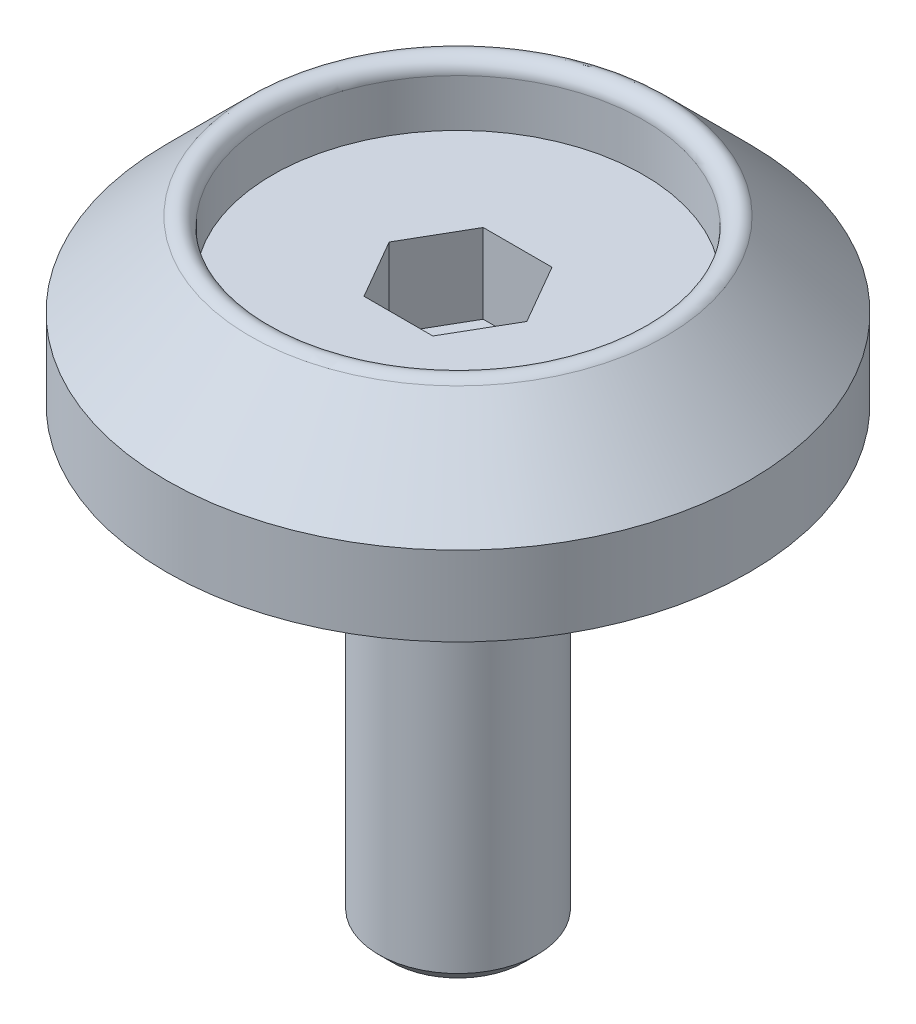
ISO-10303-21;
HEADER;
FILE_DESCRIPTION(('STEP AP214'),'2;1');
FILE_NAME('part.step','',(''),(''),'','','');
FILE_SCHEMA(('AUTOMOTIVE_DESIGN { 1 0 10303 214 1 1 1 1 }'));
ENDSEC;
DATA;
#1=APPLICATION_CONTEXT('core data for automotive mechanical design processes');
#2=APPLICATION_PROTOCOL_DEFINITION('international standard','automotive_design',2000,#1);
#3=PRODUCT_CONTEXT('',#1,'mechanical');
#4=PRODUCT('Part','Part','',(#3));
#5=PRODUCT_RELATED_PRODUCT_CATEGORY('part','',(#4));
#6=PRODUCT_DEFINITION_FORMATION('','',#4);
#7=PRODUCT_DEFINITION_CONTEXT('part definition',#1,'design');
#8=PRODUCT_DEFINITION('design','',#6,#7);
#9=PRODUCT_DEFINITION_SHAPE('','',#8);
#10=(LENGTH_UNIT() NAMED_UNIT(*) SI_UNIT(.MILLI.,.METRE.));
#11=(NAMED_UNIT(*) PLANE_ANGLE_UNIT() SI_UNIT($,.RADIAN.));
#12=(NAMED_UNIT(*) SI_UNIT($,.STERADIAN.) SOLID_ANGLE_UNIT());
#13=UNCERTAINTY_MEASURE_WITH_UNIT(LENGTH_MEASURE(1.E-05),#10,'distance_accuracy_value','');
#14=(GEOMETRIC_REPRESENTATION_CONTEXT(3) GLOBAL_UNCERTAINTY_ASSIGNED_CONTEXT((#13)) GLOBAL_UNIT_ASSIGNED_CONTEXT((#10,
#11,#12)) REPRESENTATION_CONTEXT('',''));
#15=CARTESIAN_POINT('',(0.,0.,0.));
#16=DIRECTION('',(0.,0.,1.));
#17=DIRECTION('',(1.,0.,0.));
#18=AXIS2_PLACEMENT_3D('',#15,#16,#17);
#19=CARTESIAN_POINT('',(0.,0.,0.));
#20=DIRECTION('',(0.,-1.,0.));
#21=DIRECTION('',(1.,0.,0.));
#22=AXIS2_PLACEMENT_3D('',#19,#20,#21);
#23=PLANE('',#22);
#24=CARTESIAN_POINT('',(0.,0.,0.));
#25=DIRECTION('',(0.,-1.,0.));
#26=DIRECTION('',(1.,0.,0.));
#27=AXIS2_PLACEMENT_3D('',#24,#25,#26);
#28=CIRCLE('',#27,1.25000000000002);
#29=CARTESIAN_POINT('',(1.25000000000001,0.,0.));
#30=VERTEX_POINT('',#29);
#31=EDGE_CURVE('E11',#30,#30,#28,.T.);
#32=ORIENTED_EDGE('',*,*,#31,.T.);
#33=EDGE_LOOP('',(#32));
#34=FACE_BOUND('',#33,.T.);
#35=ADVANCED_FACE('F34',(#34),#23,.T.);
#36=CARTESIAN_POINT('',(0.,0.,0.));
#37=DIRECTION('',(0.,1.,0.));
#38=DIRECTION('',(-1.,0.,0.));
#39=AXIS2_PLACEMENT_3D('',#36,#37,#38);
#40=CONICAL_SURFACE('',#39,1.25000000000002,0.785398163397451);
#41=CARTESIAN_POINT('',(0.,0.249999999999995,0.));
#42=DIRECTION('',(0.,-1.,0.));
#43=DIRECTION('',(1.,0.,0.));
#44=AXIS2_PLACEMENT_3D('',#41,#42,#43);
#45=CIRCLE('',#44,1.50000000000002);
#46=CARTESIAN_POINT('',(1.50000000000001,0.25,0.));
#47=VERTEX_POINT('',#46);
#48=EDGE_CURVE('E41',#47,#47,#45,.T.);
#49=ORIENTED_EDGE('',*,*,#48,.T.);
#50=EDGE_LOOP('',(#49));
#51=FACE_BOUND('',#50,.T.);
#52=ORIENTED_EDGE('',*,*,#31,.F.);
#53=EDGE_LOOP('',(#52));
#54=FACE_BOUND('',#53,.T.);
#55=ADVANCED_FACE('F162',(#51,#54),#40,.T.);
#56=CARTESIAN_POINT('',(0.,-3.12032212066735,0.));
#57=DIRECTION('',(0.,-1.,0.));
#58=DIRECTION('',(1.,0.,0.));
#59=AXIS2_PLACEMENT_3D('',#56,#57,#58);
#60=CYLINDRICAL_SURFACE('',#59,1.50000000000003);
#61=CARTESIAN_POINT('',(0.,8.49999999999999,0.));
#62=DIRECTION('',(0.,-1.,0.));
#63=DIRECTION('',(1.,0.,0.));
#64=AXIS2_PLACEMENT_3D('',#61,#62,#63);
#65=CIRCLE('',#64,1.50000000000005);
#66=CARTESIAN_POINT('',(1.5,8.5,0.));
#67=VERTEX_POINT('',#66);
#68=EDGE_CURVE('E157',#67,#67,#65,.T.);
#69=ORIENTED_EDGE('',*,*,#68,.T.);
#70=EDGE_LOOP('',(#69));
#71=FACE_BOUND('',#70,.T.);
#72=ORIENTED_EDGE('',*,*,#48,.F.);
#73=EDGE_LOOP('',(#72));
#74=FACE_BOUND('',#73,.T.);
#75=ADVANCED_FACE('F165',(#71,#74),#60,.T.);
#76=CARTESIAN_POINT('',(1.5,8.49999999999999,0.));
#77=DIRECTION('',(0.,-1.,0.));
#78=DIRECTION('',(1.,0.,0.));
#79=AXIS2_PLACEMENT_3D('',#76,#77,#78);
#80=PLANE('',#79);
#81=CARTESIAN_POINT('',(0.,8.49999999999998,0.));
#82=DIRECTION('',(0.,-1.,0.));
#83=DIRECTION('',(1.,0.,0.));
#84=AXIS2_PLACEMENT_3D('',#81,#82,#83);
#85=CIRCLE('',#84,5.50000000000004);
#86=CARTESIAN_POINT('',(5.5,8.5,0.));
#87=VERTEX_POINT('',#86);
#88=EDGE_CURVE('E154',#87,#87,#85,.T.);
#89=ORIENTED_EDGE('',*,*,#88,.T.);
#90=EDGE_LOOP('',(#89));
#91=FACE_BOUND('',#90,.T.);
#92=ORIENTED_EDGE('',*,*,#68,.F.);
#93=EDGE_LOOP('',(#92));
#94=FACE_BOUND('',#93,.T.);
#95=ADVANCED_FACE('F167',(#91,#94),#80,.T.);
#96=CARTESIAN_POINT('',(0.,-3.12032212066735,0.));
#97=DIRECTION('',(0.,-1.,0.));
#98=DIRECTION('',(1.,0.,0.));
#99=AXIS2_PLACEMENT_3D('',#96,#97,#98);
#100=CYLINDRICAL_SURFACE('',#99,5.50000000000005);
#101=CARTESIAN_POINT('',(0.,9.99999999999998,0.));
#102=DIRECTION('',(0.,-1.,0.));
#103=DIRECTION('',(1.,0.,0.));
#104=AXIS2_PLACEMENT_3D('',#101,#102,#103);
#105=CIRCLE('',#104,5.50000000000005);
#106=CARTESIAN_POINT('',(5.5,10.,0.));
#107=VERTEX_POINT('',#106);
#108=EDGE_CURVE('E151',#107,#107,#105,.T.);
#109=ORIENTED_EDGE('',*,*,#108,.T.);
#110=EDGE_LOOP('',(#109));
#111=FACE_BOUND('',#110,.T.);
#112=ORIENTED_EDGE('',*,*,#88,.F.);
#113=EDGE_LOOP('',(#112));
#114=FACE_BOUND('',#113,.T.);
#115=ADVANCED_FACE('F174',(#111,#114),#100,.T.);
#116=CARTESIAN_POINT('',(0.,9.99999999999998,0.));
#117=DIRECTION('',(0.,-1.,0.));
#118=DIRECTION('',(1.,0.,0.));
#119=AXIS2_PLACEMENT_3D('',#116,#117,#118);
#120=CONICAL_SURFACE('',#119,5.50000000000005,0.785398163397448);
#121=CARTESIAN_POINT('',(0.,11.5732233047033,0.));
#122=DIRECTION('',(0.,-1.,0.));
#123=DIRECTION('',(1.,0.,0.));
#124=AXIS2_PLACEMENT_3D('',#121,#122,#123);
#125=CIRCLE('',#124,3.92677669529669);
#126=CARTESIAN_POINT('',(3.92677669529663,11.5732233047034,0.));
#127=VERTEX_POINT('',#126);
#128=EDGE_CURVE('E148',#127,#127,#125,.T.);
#129=ORIENTED_EDGE('',*,*,#128,.T.);
#130=EDGE_LOOP('',(#129));
#131=FACE_BOUND('',#130,.T.);
#132=ORIENTED_EDGE('',*,*,#108,.F.);
#133=EDGE_LOOP('',(#132));
#134=FACE_BOUND('',#133,.T.);
#135=ADVANCED_FACE('F205',(#131,#134),#120,.T.);
#136=CARTESIAN_POINT('',(0.,11.3964466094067,0.));
#137=DIRECTION('',(0.,-1.,0.));
#138=DIRECTION('',(1.,0.,0.));
#139=AXIS2_PLACEMENT_3D('',#136,#137,#138);
#140=TOROIDAL_SURFACE('',#139,3.75000000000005,0.249999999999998);
#141=CARTESIAN_POINT('',(0.,11.3964466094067,0.));
#142=DIRECTION('',(0.,-1.,0.));
#143=DIRECTION('',(1.,0.,0.));
#144=AXIS2_PLACEMENT_3D('',#141,#142,#143);
#145=CIRCLE('',#144,3.50000000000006);
#146=CARTESIAN_POINT('',(3.5,11.3964466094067,0.));
#147=VERTEX_POINT('',#146);
#148=EDGE_CURVE('E145',#147,#147,#145,.T.);
#149=ORIENTED_EDGE('',*,*,#148,.T.);
#150=EDGE_LOOP('',(#149));
#151=FACE_BOUND('',#150,.T.);
#152=ORIENTED_EDGE('',*,*,#128,.F.);
#153=EDGE_LOOP('',(#152));
#154=FACE_BOUND('',#153,.T.);
#155=ADVANCED_FACE('F215',(#151,#154),#140,.T.);
#156=CARTESIAN_POINT('',(0.,-3.12032212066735,0.));
#157=DIRECTION('',(0.,-1.,0.));
#158=DIRECTION('',(1.,0.,0.));
#159=AXIS2_PLACEMENT_3D('',#156,#157,#158);
#160=CYLINDRICAL_SURFACE('',#159,3.50000000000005);
#161=CARTESIAN_POINT('',(0.,10.5,0.));
#162=DIRECTION('',(0.,-1.,0.));
#163=DIRECTION('',(1.,0.,0.));
#164=AXIS2_PLACEMENT_3D('',#161,#162,#163);
#165=CIRCLE('',#164,3.50000000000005);
#166=CARTESIAN_POINT('',(3.5,10.5,0.));
#167=VERTEX_POINT('',#166);
#168=EDGE_CURVE('E136',#167,#167,#165,.T.);
#169=ORIENTED_EDGE('',*,*,#168,.T.);
#170=EDGE_LOOP('',(#169));
#171=FACE_BOUND('',#170,.T.);
#172=ORIENTED_EDGE('',*,*,#148,.F.);
#173=EDGE_LOOP('',(#172));
#174=FACE_BOUND('',#173,.T.);
#175=ADVANCED_FACE('F225',(#171,#174),#160,.F.);
#176=CARTESIAN_POINT('',(0.,10.5,0.));
#177=DIRECTION('',(0.,1.,0.));
#178=DIRECTION('',(-1.,0.,0.));
#179=AXIS2_PLACEMENT_3D('',#176,#177,#178);
#180=PLANE('',#179);
#181=DIRECTION('',(0.499999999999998,0.,0.86602540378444));
#182=VECTOR('',#181,1.);
#183=CARTESIAN_POINT('',(-0.649519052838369,10.5,1.125));
#184=LINE('',#183,#182);
#185=CARTESIAN_POINT('',(-1.2990381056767,10.5,0.));
#186=VERTEX_POINT('',#185);
#187=CARTESIAN_POINT('',(-0.649519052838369,10.5,1.125));
#188=VERTEX_POINT('',#187);
#189=EDGE_CURVE('E48',#186,#188,#184,.T.);
#190=ORIENTED_EDGE('',*,*,#189,.F.);
#191=DIRECTION('',(-0.500000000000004,0.,0.866025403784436));
#192=VECTOR('',#191,1.);
#193=CARTESIAN_POINT('',(-1.2990381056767,10.5,0.));
#194=LINE('',#193,#192);
#195=CARTESIAN_POINT('',(-0.649519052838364,10.5,-1.125));
#196=VERTEX_POINT('',#195);
#197=EDGE_CURVE('E118',#196,#186,#194,.T.);
#198=ORIENTED_EDGE('',*,*,#197,.F.);
#199=DIRECTION('',(-1.,0.,0.));
#200=VECTOR('',#199,1.);
#201=CARTESIAN_POINT('',(-0.649519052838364,10.5,-1.125));
#202=LINE('',#201,#200);
#203=CARTESIAN_POINT('',(0.649519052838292,10.5,-1.125));
#204=VERTEX_POINT('',#203);
#205=EDGE_CURVE('E112',#204,#196,#202,.T.);
#206=ORIENTED_EDGE('',*,*,#205,.F.);
#207=DIRECTION('',(-0.499999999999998,0.,-0.86602540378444));
#208=VECTOR('',#207,1.);
#209=CARTESIAN_POINT('',(0.649519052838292,10.5,-1.125));
#210=LINE('',#209,#208);
#211=CARTESIAN_POINT('',(1.29903810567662,10.5,0.));
#212=VERTEX_POINT('',#211);
#213=EDGE_CURVE('E110',#212,#204,#210,.T.);
#214=ORIENTED_EDGE('',*,*,#213,.F.);
#215=DIRECTION('',(0.500000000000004,0.,-0.866025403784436));
#216=VECTOR('',#215,1.);
#217=CARTESIAN_POINT('',(1.29903810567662,10.5,0.));
#218=LINE('',#217,#216);
#219=CARTESIAN_POINT('',(0.649519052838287,10.5,1.125));
#220=VERTEX_POINT('',#219);
#221=EDGE_CURVE('E91',#220,#212,#218,.T.);
#222=ORIENTED_EDGE('',*,*,#221,.F.);
#223=DIRECTION('',(1.,0.,0.));
#224=VECTOR('',#223,1.);
#225=CARTESIAN_POINT('',(0.649519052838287,10.5,1.125));
#226=LINE('',#225,#224);
#227=EDGE_CURVE('E102',#188,#220,#226,.T.);
#228=ORIENTED_EDGE('',*,*,#227,.F.);
#229=EDGE_LOOP('',(#190,#198,#206,#214,#222,#228));
#230=FACE_BOUND('',#229,.T.);
#231=ORIENTED_EDGE('',*,*,#168,.F.);
#232=EDGE_LOOP('',(#231));
#233=FACE_BOUND('',#232,.T.);
#234=ADVANCED_FACE('F106',(#230,#233),#180,.T.);
#235=CARTESIAN_POINT('',(-0.649519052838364,8.99999999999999,1.125));
#236=DIRECTION('',(-0.86602540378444,0.,0.499999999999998));
#237=DIRECTION('',(0.499999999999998,0.,0.86602540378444));
#238=AXIS2_PLACEMENT_3D('',#235,#236,#237);
#239=PLANE('',#238);
#240=ORIENTED_EDGE('',*,*,#189,.T.);
#241=DIRECTION('',(0.,1.,0.));
#242=VECTOR('',#241,1.);
#243=CARTESIAN_POINT('',(-0.649519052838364,8.99999999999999,1.125));
#244=LINE('',#243,#242);
#245=CARTESIAN_POINT('',(-0.649519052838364,8.99999999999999,1.125));
#246=VERTEX_POINT('',#245);
#247=EDGE_CURVE('E99',#246,#188,#244,.T.);
#248=ORIENTED_EDGE('',*,*,#247,.F.);
#249=DIRECTION('',(0.499999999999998,0.,0.86602540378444));
#250=VECTOR('',#249,1.);
#251=CARTESIAN_POINT('',(-0.649519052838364,8.99999999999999,1.125));
#252=LINE('',#251,#250);
#253=CARTESIAN_POINT('',(-1.29903810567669,8.99999999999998,0.));
#254=VERTEX_POINT('',#253);
#255=EDGE_CURVE('E120',#254,#246,#252,.T.);
#256=ORIENTED_EDGE('',*,*,#255,.F.);
#257=DIRECTION('',(0.,1.,0.));
#258=VECTOR('',#257,1.);
#259=CARTESIAN_POINT('',(-1.29903810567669,8.99999999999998,0.));
#260=LINE('',#259,#258);
#261=EDGE_CURVE('E55',#254,#186,#260,.T.);
#262=ORIENTED_EDGE('',*,*,#261,.T.);
#263=EDGE_LOOP('',(#240,#248,#256,#262));
#264=FACE_BOUND('',#263,.T.);
#265=ADVANCED_FACE('F244',(#264),#239,.F.);
#266=CARTESIAN_POINT('',(-1.29903810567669,8.99999999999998,0.));
#267=DIRECTION('',(-0.866025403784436,0.,-0.500000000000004));
#268=DIRECTION('',(-0.500000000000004,0.,0.866025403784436));
#269=AXIS2_PLACEMENT_3D('',#266,#267,#268);
#270=PLANE('',#269);
#271=ORIENTED_EDGE('',*,*,#197,.T.);
#272=ORIENTED_EDGE('',*,*,#261,.F.);
#273=DIRECTION('',(-0.500000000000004,0.,0.866025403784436));
#274=VECTOR('',#273,1.);
#275=CARTESIAN_POINT('',(-1.29903810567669,8.99999999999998,0.));
#276=LINE('',#275,#274);
#277=CARTESIAN_POINT('',(-0.649519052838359,8.99999999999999,-1.125));
#278=VERTEX_POINT('',#277);
#279=EDGE_CURVE('E132',#278,#254,#276,.T.);
#280=ORIENTED_EDGE('',*,*,#279,.F.);
#281=DIRECTION('',(0.,1.,0.));
#282=VECTOR('',#281,1.);
#283=CARTESIAN_POINT('',(-0.649519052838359,8.99999999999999,-1.125));
#284=LINE('',#283,#282);
#285=EDGE_CURVE('E137',#278,#196,#284,.T.);
#286=ORIENTED_EDGE('',*,*,#285,.T.);
#287=EDGE_LOOP('',(#271,#272,#280,#286));
#288=FACE_BOUND('',#287,.T.);
#289=ADVANCED_FACE('F253',(#288),#270,.F.);
#290=CARTESIAN_POINT('',(-0.649519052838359,8.99999999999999,-1.125));
#291=DIRECTION('',(0.,0.,-1.));
#292=DIRECTION('',(-1.,0.,0.));
#293=AXIS2_PLACEMENT_3D('',#290,#291,#292);
#294=PLANE('',#293);
#295=ORIENTED_EDGE('',*,*,#205,.T.);
#296=ORIENTED_EDGE('',*,*,#285,.F.);
#297=DIRECTION('',(-1.,0.,0.));
#298=VECTOR('',#297,1.);
#299=CARTESIAN_POINT('',(-0.649519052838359,8.99999999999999,-1.125));
#300=LINE('',#299,#298);
#301=CARTESIAN_POINT('',(0.649519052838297,8.99999999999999,-1.125));
#302=VERTEX_POINT('',#301);
#303=EDGE_CURVE('E129',#302,#278,#300,.T.);
#304=ORIENTED_EDGE('',*,*,#303,.F.);
#305=DIRECTION('',(0.,1.,0.));
#306=VECTOR('',#305,1.);
#307=CARTESIAN_POINT('',(0.649519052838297,8.99999999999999,-1.125));
#308=LINE('',#307,#306);
#309=EDGE_CURVE('E139',#302,#204,#308,.T.);
#310=ORIENTED_EDGE('',*,*,#309,.T.);
#311=EDGE_LOOP('',(#295,#296,#304,#310));
#312=FACE_BOUND('',#311,.T.);
#313=ADVANCED_FACE('F262',(#312),#294,.F.);
#314=CARTESIAN_POINT('',(0.649519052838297,8.99999999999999,-1.125));
#315=DIRECTION('',(0.86602540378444,0.,-0.499999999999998));
#316=DIRECTION('',(-0.499999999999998,0.,-0.86602540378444));
#317=AXIS2_PLACEMENT_3D('',#314,#315,#316);
#318=PLANE('',#317);
#319=ORIENTED_EDGE('',*,*,#213,.T.);
#320=ORIENTED_EDGE('',*,*,#309,.F.);
#321=DIRECTION('',(-0.499999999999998,0.,-0.86602540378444));
#322=VECTOR('',#321,1.);
#323=CARTESIAN_POINT('',(0.649519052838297,8.99999999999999,-1.125));
#324=LINE('',#323,#322);
#325=CARTESIAN_POINT('',(1.29903810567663,8.99999999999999,0.));
#326=VERTEX_POINT('',#325);
#327=EDGE_CURVE('E126',#326,#302,#324,.T.);
#328=ORIENTED_EDGE('',*,*,#327,.F.);
#329=DIRECTION('',(0.,1.,0.));
#330=VECTOR('',#329,1.);
#331=CARTESIAN_POINT('',(1.29903810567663,8.99999999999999,0.));
#332=LINE('',#331,#330);
#333=EDGE_CURVE('E98',#326,#212,#332,.T.);
#334=ORIENTED_EDGE('',*,*,#333,.T.);
#335=EDGE_LOOP('',(#319,#320,#328,#334));
#336=FACE_BOUND('',#335,.T.);
#337=ADVANCED_FACE('F271',(#336),#318,.F.);
#338=CARTESIAN_POINT('',(1.29903810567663,8.99999999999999,0.));
#339=DIRECTION('',(0.866025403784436,0.,0.500000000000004));
#340=DIRECTION('',(0.500000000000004,0.,-0.866025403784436));
#341=AXIS2_PLACEMENT_3D('',#338,#339,#340);
#342=PLANE('',#341);
#343=ORIENTED_EDGE('',*,*,#221,.T.);
#344=ORIENTED_EDGE('',*,*,#333,.F.);
#345=DIRECTION('',(0.500000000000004,0.,-0.866025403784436));
#346=VECTOR('',#345,1.);
#347=CARTESIAN_POINT('',(1.29903810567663,8.99999999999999,0.));
#348=LINE('',#347,#346);
#349=CARTESIAN_POINT('',(0.649519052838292,8.99999999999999,1.125));
#350=VERTEX_POINT('',#349);
#351=EDGE_CURVE('E94',#350,#326,#348,.T.);
#352=ORIENTED_EDGE('',*,*,#351,.F.);
#353=DIRECTION('',(0.,1.,0.));
#354=VECTOR('',#353,1.);
#355=CARTESIAN_POINT('',(0.649519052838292,8.99999999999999,1.125));
#356=LINE('',#355,#354);
#357=EDGE_CURVE('E87',#350,#220,#356,.T.);
#358=ORIENTED_EDGE('',*,*,#357,.T.);
#359=EDGE_LOOP('',(#343,#344,#352,#358));
#360=FACE_BOUND('',#359,.T.);
#361=ADVANCED_FACE('F89',(#360),#342,.F.);
#362=CARTESIAN_POINT('',(0.649519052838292,8.99999999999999,1.125));
#363=DIRECTION('',(0.,0.,1.));
#364=DIRECTION('',(1.,0.,0.));
#365=AXIS2_PLACEMENT_3D('',#362,#363,#364);
#366=PLANE('',#365);
#367=ORIENTED_EDGE('',*,*,#227,.T.);
#368=ORIENTED_EDGE('',*,*,#357,.F.);
#369=DIRECTION('',(1.,0.,0.));
#370=VECTOR('',#369,1.);
#371=CARTESIAN_POINT('',(0.649519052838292,8.99999999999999,1.125));
#372=LINE('',#371,#370);
#373=EDGE_CURVE('E123',#246,#350,#372,.T.);
#374=ORIENTED_EDGE('',*,*,#373,.F.);
#375=ORIENTED_EDGE('',*,*,#247,.T.);
#376=EDGE_LOOP('',(#367,#368,#374,#375));
#377=FACE_BOUND('',#376,.T.);
#378=ADVANCED_FACE('F103',(#377),#366,.F.);
#379=CARTESIAN_POINT('',(-1.29903810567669,8.99999999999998,0.));
#380=DIRECTION('',(0.,-1.,0.));
#381=DIRECTION('',(1.,0.,0.));
#382=AXIS2_PLACEMENT_3D('',#379,#380,#381);
#383=PLANE('',#382);
#384=ORIENTED_EDGE('',*,*,#255,.T.);
#385=ORIENTED_EDGE('',*,*,#373,.T.);
#386=ORIENTED_EDGE('',*,*,#351,.T.);
#387=ORIENTED_EDGE('',*,*,#327,.T.);
#388=ORIENTED_EDGE('',*,*,#303,.T.);
#389=ORIENTED_EDGE('',*,*,#279,.T.);
#390=EDGE_LOOP('',(#384,#385,#386,#387,#388,#389));
#391=FACE_BOUND('',#390,.T.);
#392=ADVANCED_FACE('F298',(#391),#383,.F.);
#393=CLOSED_SHELL('',(#35,#55,#75,#95,#115,#135,#155,#175,#234,#265,#289,#313,#337,#361,#378,#392));
#394=MANIFOLD_SOLID_BREP('B2',#393);
#395=ADVANCED_BREP_SHAPE_REPRESENTATION('',(#18,#394),#14);
#396=SHAPE_DEFINITION_REPRESENTATION(#9,#395);
ENDSEC;
END-ISO-10303-21;
